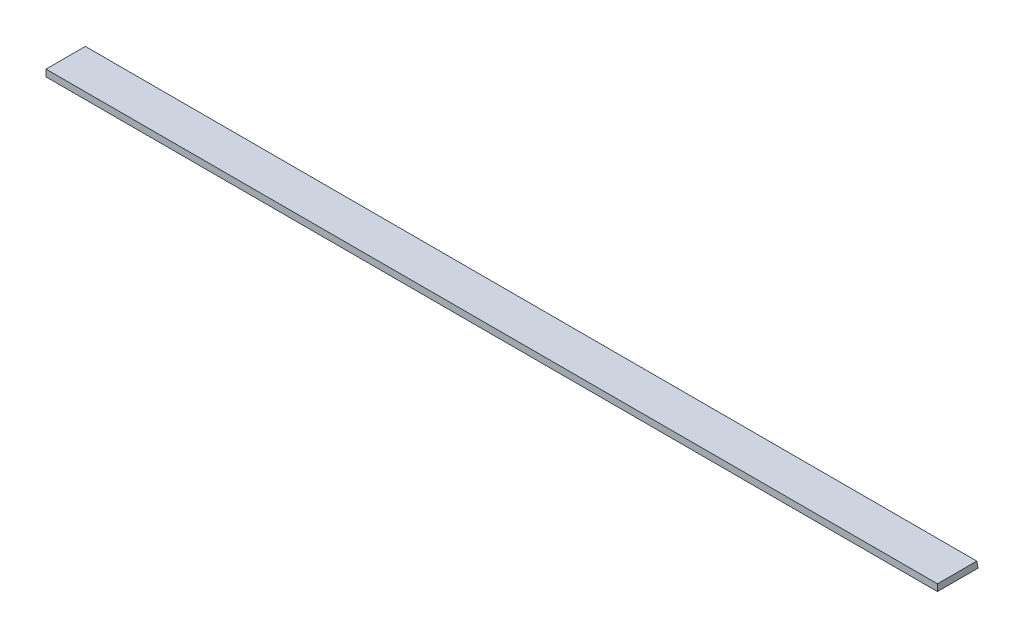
from build123d import *

# Parameters (mm, degrees)
EXTRUSION1_DEPTH = 330


with BuildPart() as part:
    # Esquisse1 → Extrusion1 (new, symmetric)
    with BuildSketch(Plane(origin=(0, 0, 0), x_dir=(0, 0, -1), z_dir=(1, 0, 0))):
        Polygon((-15, 5), (14.118365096, 5), (15, 0), (-15, 0), align=None)
    extrude(amount=EXTRUSION1_DEPTH, both=True)


solid = part.part
